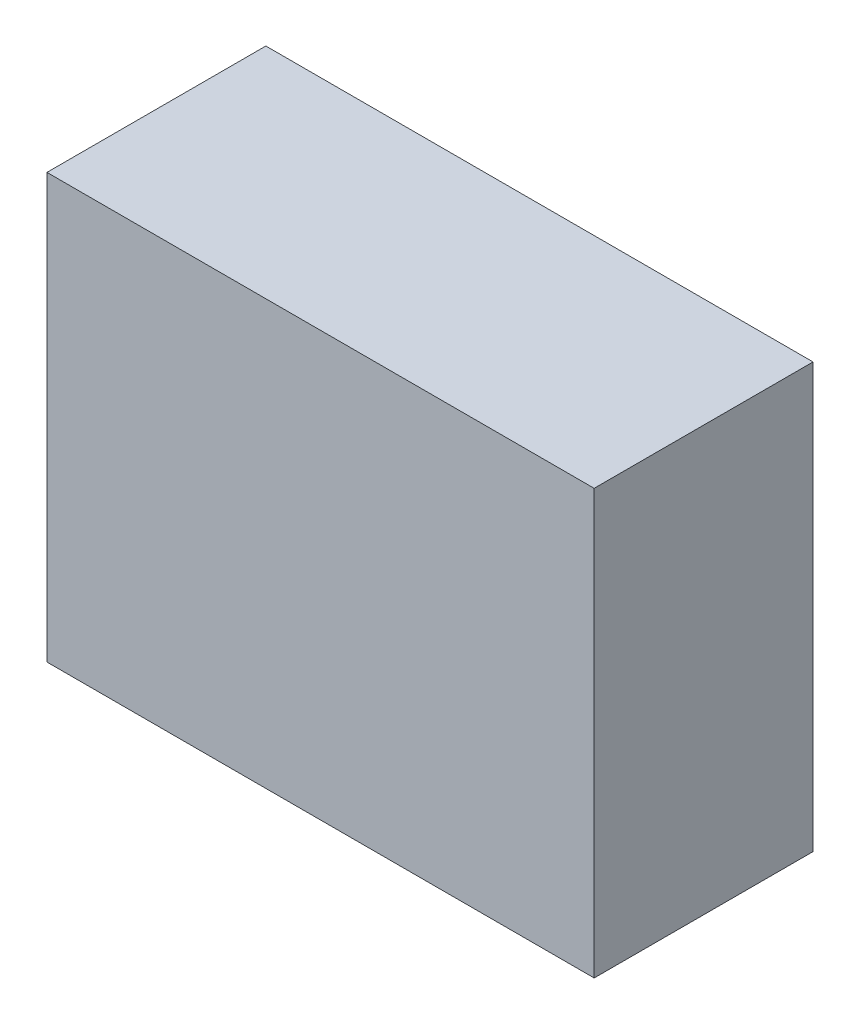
ISO-10303-21;
HEADER;
FILE_DESCRIPTION(('STEP AP214'),'2;1');
FILE_NAME('part.step','',(''),(''),'','','');
FILE_SCHEMA(('AUTOMOTIVE_DESIGN { 1 0 10303 214 1 1 1 1 }'));
ENDSEC;
DATA;
#1=APPLICATION_CONTEXT('core data for automotive mechanical design processes');
#2=APPLICATION_PROTOCOL_DEFINITION('international standard','automotive_design',2000,#1);
#3=PRODUCT_CONTEXT('',#1,'mechanical');
#4=PRODUCT('Part','Part','',(#3));
#5=PRODUCT_RELATED_PRODUCT_CATEGORY('part','',(#4));
#6=PRODUCT_DEFINITION_FORMATION('','',#4);
#7=PRODUCT_DEFINITION_CONTEXT('part definition',#1,'design');
#8=PRODUCT_DEFINITION('design','',#6,#7);
#9=PRODUCT_DEFINITION_SHAPE('','',#8);
#10=(LENGTH_UNIT() NAMED_UNIT(*) SI_UNIT(.MILLI.,.METRE.));
#11=(NAMED_UNIT(*) PLANE_ANGLE_UNIT() SI_UNIT($,.RADIAN.));
#12=(NAMED_UNIT(*) SI_UNIT($,.STERADIAN.) SOLID_ANGLE_UNIT());
#13=UNCERTAINTY_MEASURE_WITH_UNIT(LENGTH_MEASURE(1.E-05),#10,'distance_accuracy_value','');
#14=(GEOMETRIC_REPRESENTATION_CONTEXT(3) GLOBAL_UNCERTAINTY_ASSIGNED_CONTEXT((#13)) GLOBAL_UNIT_ASSIGNED_CONTEXT((#10,
#11,#12)) REPRESENTATION_CONTEXT('',''));
#15=CARTESIAN_POINT('',(0.,0.,0.));
#16=DIRECTION('',(0.,0.,1.));
#17=DIRECTION('',(1.,0.,0.));
#18=AXIS2_PLACEMENT_3D('',#15,#16,#17);
#19=CARTESIAN_POINT('',(0.,0.,8.));
#20=DIRECTION('',(1.,0.,0.));
#21=DIRECTION('',(0.,1.,0.));
#22=AXIS2_PLACEMENT_3D('',#19,#20,#21);
#23=PLANE('',#22);
#24=DIRECTION('',(0.,-1.,0.));
#25=VECTOR('',#24,1.);
#26=CARTESIAN_POINT('',(0.,0.,0.));
#27=LINE('',#26,#25);
#28=CARTESIAN_POINT('',(0.,15.5,0.));
#29=VERTEX_POINT('',#28);
#30=CARTESIAN_POINT('',(0.,0.,0.));
#31=VERTEX_POINT('',#30);
#32=EDGE_CURVE('E94',#29,#31,#27,.T.);
#33=ORIENTED_EDGE('',*,*,#32,.T.);
#34=DIRECTION('',(0.,0.,-1.));
#35=VECTOR('',#34,1.);
#36=CARTESIAN_POINT('',(0.,0.,8.));
#37=LINE('',#36,#35);
#38=CARTESIAN_POINT('',(0.,0.,8.));
#39=VERTEX_POINT('',#38);
#40=EDGE_CURVE('E11',#39,#31,#37,.T.);
#41=ORIENTED_EDGE('',*,*,#40,.F.);
#42=DIRECTION('',(0.,-1.,0.));
#43=VECTOR('',#42,1.);
#44=CARTESIAN_POINT('',(0.,0.,8.));
#45=LINE('',#44,#43);
#46=CARTESIAN_POINT('',(0.,15.5,8.));
#47=VERTEX_POINT('',#46);
#48=EDGE_CURVE('E82',#47,#39,#45,.T.);
#49=ORIENTED_EDGE('',*,*,#48,.F.);
#50=DIRECTION('',(0.,0.,-1.));
#51=VECTOR('',#50,1.);
#52=CARTESIAN_POINT('',(0.,15.5,8.));
#53=LINE('',#52,#51);
#54=EDGE_CURVE('E90',#47,#29,#53,.T.);
#55=ORIENTED_EDGE('',*,*,#54,.T.);
#56=EDGE_LOOP('',(#33,#41,#49,#55));
#57=FACE_BOUND('',#56,.T.);
#58=ADVANCED_FACE('F31',(#57),#23,.F.);
#59=CARTESIAN_POINT('',(0.,0.,8.));
#60=DIRECTION('',(0.,1.,0.));
#61=DIRECTION('',(0.,0.,1.));
#62=AXIS2_PLACEMENT_3D('',#59,#60,#61);
#63=PLANE('',#62);
#64=DIRECTION('',(1.,0.,0.));
#65=VECTOR('',#64,1.);
#66=CARTESIAN_POINT('',(0.,0.,0.));
#67=LINE('',#66,#65);
#68=CARTESIAN_POINT('',(20.,0.,0.));
#69=VERTEX_POINT('',#68);
#70=EDGE_CURVE('E86',#31,#69,#67,.T.);
#71=ORIENTED_EDGE('',*,*,#70,.T.);
#72=DIRECTION('',(0.,0.,-1.));
#73=VECTOR('',#72,1.);
#74=CARTESIAN_POINT('',(20.,0.,8.));
#75=LINE('',#74,#73);
#76=CARTESIAN_POINT('',(20.,0.,8.));
#77=VERTEX_POINT('',#76);
#78=EDGE_CURVE('E39',#77,#69,#75,.T.);
#79=ORIENTED_EDGE('',*,*,#78,.F.);
#80=DIRECTION('',(1.,0.,0.));
#81=VECTOR('',#80,1.);
#82=CARTESIAN_POINT('',(0.,0.,8.));
#83=LINE('',#82,#81);
#84=EDGE_CURVE('E77',#39,#77,#83,.T.);
#85=ORIENTED_EDGE('',*,*,#84,.F.);
#86=ORIENTED_EDGE('',*,*,#40,.T.);
#87=EDGE_LOOP('',(#71,#79,#85,#86));
#88=FACE_BOUND('',#87,.T.);
#89=ADVANCED_FACE('F85',(#88),#63,.F.);
#90=CARTESIAN_POINT('',(20.,0.,8.));
#91=DIRECTION('',(-1.,0.,0.));
#92=DIRECTION('',(0.,-1.,0.));
#93=AXIS2_PLACEMENT_3D('',#90,#91,#92);
#94=PLANE('',#93);
#95=DIRECTION('',(0.,1.,0.));
#96=VECTOR('',#95,1.);
#97=CARTESIAN_POINT('',(20.,0.,0.));
#98=LINE('',#97,#96);
#99=CARTESIAN_POINT('',(20.,15.5,0.));
#100=VERTEX_POINT('',#99);
#101=EDGE_CURVE('E64',#69,#100,#98,.T.);
#102=ORIENTED_EDGE('',*,*,#101,.T.);
#103=DIRECTION('',(0.,0.,-1.));
#104=VECTOR('',#103,1.);
#105=CARTESIAN_POINT('',(20.,15.5,8.));
#106=LINE('',#105,#104);
#107=CARTESIAN_POINT('',(20.,15.5,8.));
#108=VERTEX_POINT('',#107);
#109=EDGE_CURVE('E87',#108,#100,#106,.T.);
#110=ORIENTED_EDGE('',*,*,#109,.F.);
#111=DIRECTION('',(0.,1.,0.));
#112=VECTOR('',#111,1.);
#113=CARTESIAN_POINT('',(20.,0.,8.));
#114=LINE('',#113,#112);
#115=EDGE_CURVE('E80',#77,#108,#114,.T.);
#116=ORIENTED_EDGE('',*,*,#115,.F.);
#117=ORIENTED_EDGE('',*,*,#78,.T.);
#118=EDGE_LOOP('',(#102,#110,#116,#117));
#119=FACE_BOUND('',#118,.T.);
#120=ADVANCED_FACE('F88',(#119),#94,.F.);
#121=CARTESIAN_POINT('',(0.,15.5,8.));
#122=DIRECTION('',(0.,-1.,0.));
#123=DIRECTION('',(0.,0.,-1.));
#124=AXIS2_PLACEMENT_3D('',#121,#122,#123);
#125=PLANE('',#124);
#126=DIRECTION('',(-1.,0.,0.));
#127=VECTOR('',#126,1.);
#128=CARTESIAN_POINT('',(0.,15.5,0.));
#129=LINE('',#128,#127);
#130=EDGE_CURVE('E70',#100,#29,#129,.T.);
#131=ORIENTED_EDGE('',*,*,#130,.T.);
#132=ORIENTED_EDGE('',*,*,#54,.F.);
#133=DIRECTION('',(-1.,0.,0.));
#134=VECTOR('',#133,1.);
#135=CARTESIAN_POINT('',(0.,15.5,8.));
#136=LINE('',#135,#134);
#137=EDGE_CURVE('E47',#108,#47,#136,.T.);
#138=ORIENTED_EDGE('',*,*,#137,.F.);
#139=ORIENTED_EDGE('',*,*,#109,.T.);
#140=EDGE_LOOP('',(#131,#132,#138,#139));
#141=FACE_BOUND('',#140,.T.);
#142=ADVANCED_FACE('F101',(#141),#125,.F.);
#143=CARTESIAN_POINT('',(0.,15.5,8.));
#144=DIRECTION('',(0.,0.,-1.));
#145=DIRECTION('',(-1.,0.,0.));
#146=AXIS2_PLACEMENT_3D('',#143,#144,#145);
#147=PLANE('',#146);
#148=ORIENTED_EDGE('',*,*,#48,.T.);
#149=ORIENTED_EDGE('',*,*,#84,.T.);
#150=ORIENTED_EDGE('',*,*,#115,.T.);
#151=ORIENTED_EDGE('',*,*,#137,.T.);
#152=EDGE_LOOP('',(#148,#149,#150,#151));
#153=FACE_BOUND('',#152,.T.);
#154=ADVANCED_FACE('F78',(#153),#147,.F.);
#155=CARTESIAN_POINT('',(0.,15.5,0.));
#156=DIRECTION('',(0.,0.,-1.));
#157=DIRECTION('',(-1.,0.,0.));
#158=AXIS2_PLACEMENT_3D('',#155,#156,#157);
#159=PLANE('',#158);
#160=ORIENTED_EDGE('',*,*,#32,.F.);
#161=ORIENTED_EDGE('',*,*,#130,.F.);
#162=ORIENTED_EDGE('',*,*,#101,.F.);
#163=ORIENTED_EDGE('',*,*,#70,.F.);
#164=EDGE_LOOP('',(#160,#161,#162,#163));
#165=FACE_BOUND('',#164,.T.);
#166=ADVANCED_FACE('F104',(#165),#159,.T.);
#167=CLOSED_SHELL('',(#58,#89,#120,#142,#154,#166));
#168=MANIFOLD_SOLID_BREP('B2',#167);
#169=ADVANCED_BREP_SHAPE_REPRESENTATION('',(#18,#168),#14);
#170=SHAPE_DEFINITION_REPRESENTATION(#9,#169);
ENDSEC;
END-ISO-10303-21;
